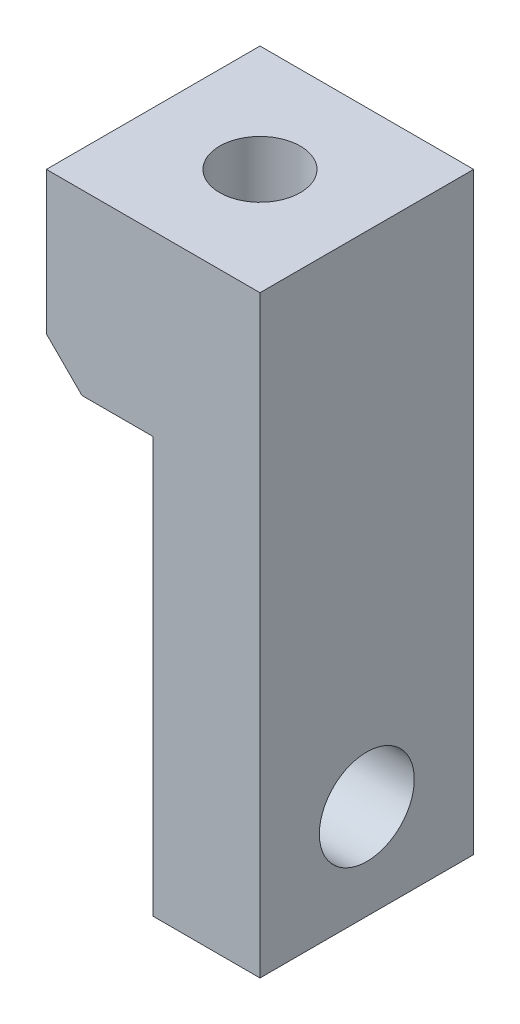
ISO-10303-21;
HEADER;
FILE_DESCRIPTION(('STEP AP214'),'2;1');
FILE_NAME('part.step','',(''),(''),'','','');
FILE_SCHEMA(('AUTOMOTIVE_DESIGN { 1 0 10303 214 1 1 1 1 }'));
ENDSEC;
DATA;
#1=APPLICATION_CONTEXT('core data for automotive mechanical design processes');
#2=APPLICATION_PROTOCOL_DEFINITION('international standard','automotive_design',2000,#1);
#3=PRODUCT_CONTEXT('',#1,'mechanical');
#4=PRODUCT('Part','Part','',(#3));
#5=PRODUCT_RELATED_PRODUCT_CATEGORY('part','',(#4));
#6=PRODUCT_DEFINITION_FORMATION('','',#4);
#7=PRODUCT_DEFINITION_CONTEXT('part definition',#1,'design');
#8=PRODUCT_DEFINITION('design','',#6,#7);
#9=PRODUCT_DEFINITION_SHAPE('','',#8);
#10=(LENGTH_UNIT() NAMED_UNIT(*) SI_UNIT(.MILLI.,.METRE.));
#11=(NAMED_UNIT(*) PLANE_ANGLE_UNIT() SI_UNIT($,.RADIAN.));
#12=(NAMED_UNIT(*) SI_UNIT($,.STERADIAN.) SOLID_ANGLE_UNIT());
#13=UNCERTAINTY_MEASURE_WITH_UNIT(LENGTH_MEASURE(1.E-05),#10,'distance_accuracy_value','');
#14=(GEOMETRIC_REPRESENTATION_CONTEXT(3) GLOBAL_UNCERTAINTY_ASSIGNED_CONTEXT((#13)) GLOBAL_UNIT_ASSIGNED_CONTEXT((#10,
#11,#12)) REPRESENTATION_CONTEXT('',''));
#15=CARTESIAN_POINT('',(0.,0.,0.));
#16=DIRECTION('',(0.,0.,1.));
#17=DIRECTION('',(1.,0.,0.));
#18=AXIS2_PLACEMENT_3D('',#15,#16,#17);
#19=CARTESIAN_POINT('',(8.99999999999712,2.22044604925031E-13,18.000000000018));
#20=DIRECTION('',(0.,1.00000000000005,0.));
#21=DIRECTION('',(-0.999999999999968,0.,0.));
#22=AXIS2_PLACEMENT_3D('',#19,#20,#21);
#23=PLANE('',#22);
#24=DIRECTION('',(0.999999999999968,0.,0.));
#25=VECTOR('',#24,1.);
#26=CARTESIAN_POINT('',(9.00000000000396,-9.99200722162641E-13,1.11022302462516E-13));
#27=LINE('',#26,#25);
#28=CARTESIAN_POINT('',(0.,0.,0.));
#29=VERTEX_POINT('',#28);
#30=CARTESIAN_POINT('',(9.00000000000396,-9.99200722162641E-13,1.11022302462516E-13));
#31=VERTEX_POINT('',#30);
#32=EDGE_CURVE('E139',#29,#31,#27,.T.);
#33=ORIENTED_EDGE('',*,*,#32,.T.);
#34=DIRECTION('',(0.,0.,-1.00000000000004));
#35=VECTOR('',#34,1.);
#36=CARTESIAN_POINT('',(8.99999999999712,2.22044604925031E-13,18.000000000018));
#37=LINE('',#36,#35);
#38=CARTESIAN_POINT('',(8.99999999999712,2.22044604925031E-13,18.000000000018));
#39=VERTEX_POINT('',#38);
#40=EDGE_CURVE('E164',#39,#31,#37,.T.);
#41=ORIENTED_EDGE('',*,*,#40,.F.);
#42=DIRECTION('',(0.999999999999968,0.,0.));
#43=VECTOR('',#42,1.);
#44=CARTESIAN_POINT('',(8.99999999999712,2.22044604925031E-13,18.000000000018));
#45=LINE('',#44,#43);
#46=CARTESIAN_POINT('',(2.60902410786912E-12,-3.33066907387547E-13,17.9999999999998));
#47=VERTEX_POINT('',#46);
#48=EDGE_CURVE('E153',#47,#39,#45,.T.);
#49=ORIENTED_EDGE('',*,*,#48,.F.);
#50=DIRECTION('',(0.,0.,-1.00000000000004));
#51=VECTOR('',#50,1.);
#52=CARTESIAN_POINT('',(2.60902410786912E-12,-3.33066907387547E-13,17.9999999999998));
#53=LINE('',#52,#51);
#54=EDGE_CURVE('E135',#47,#29,#53,.T.);
#55=ORIENTED_EDGE('',*,*,#54,.T.);
#56=EDGE_LOOP('',(#33,#41,#49,#55));
#57=FACE_BOUND('',#56,.T.);
#58=ADVANCED_FACE('F34',(#57),#23,.F.);
#59=CARTESIAN_POINT('',(9.00000000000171,50.0000000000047,17.9999999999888));
#60=DIRECTION('',(-0.999999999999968,0.,0.));
#61=DIRECTION('',(0.,-1.00000000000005,0.));
#62=AXIS2_PLACEMENT_3D('',#59,#60,#61);
#63=PLANE('',#62);
#64=CARTESIAN_POINT('',(9.00000000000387,8.00000000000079,8.99999999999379));
#65=DIRECTION('',(-0.999999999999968,0.,0.));
#66=DIRECTION('',(0.,0.,1.00000000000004));
#67=AXIS2_PLACEMENT_3D('',#64,#65,#66);
#68=CIRCLE('',#67,4.);
#69=CARTESIAN_POINT('',(9.00000000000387,8.00000000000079,12.999999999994));
#70=VERTEX_POINT('',#69);
#71=EDGE_CURVE('E241',#70,#70,#68,.T.);
#72=ORIENTED_EDGE('',*,*,#71,.T.);
#73=EDGE_LOOP('',(#72));
#74=FACE_BOUND('',#73,.T.);
#75=DIRECTION('',(0.,1.00000000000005,0.));
#76=VECTOR('',#75,1.);
#77=CARTESIAN_POINT('',(8.99999999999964,50.0000000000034,1.22124532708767E-12));
#78=LINE('',#77,#76);
#79=CARTESIAN_POINT('',(8.99999999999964,50.0000000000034,1.22124532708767E-12));
#80=VERTEX_POINT('',#79);
#81=EDGE_CURVE('E142',#31,#80,#78,.T.);
#82=ORIENTED_EDGE('',*,*,#81,.T.);
#83=DIRECTION('',(0.,0.,-1.00000000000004));
#84=VECTOR('',#83,1.);
#85=CARTESIAN_POINT('',(9.00000000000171,50.0000000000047,17.9999999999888));
#86=LINE('',#85,#84);
#87=CARTESIAN_POINT('',(9.00000000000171,50.0000000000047,17.9999999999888));
#88=VERTEX_POINT('',#87);
#89=EDGE_CURVE('E161',#88,#80,#86,.T.);
#90=ORIENTED_EDGE('',*,*,#89,.F.);
#91=DIRECTION('',(0.,1.00000000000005,0.));
#92=VECTOR('',#91,1.);
#93=CARTESIAN_POINT('',(9.00000000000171,50.0000000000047,17.9999999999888));
#94=LINE('',#93,#92);
#95=EDGE_CURVE('E95',#39,#88,#94,.T.);
#96=ORIENTED_EDGE('',*,*,#95,.F.);
#97=ORIENTED_EDGE('',*,*,#40,.T.);
#98=EDGE_LOOP('',(#82,#90,#96,#97));
#99=FACE_BOUND('',#98,.T.);
#100=ADVANCED_FACE('F204',(#74,#99),#63,.F.);
#101=CARTESIAN_POINT('',(-8.99999999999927,50.0000000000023,17.9999999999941));
#102=DIRECTION('',(0.,-1.00000000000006,0.));
#103=DIRECTION('',(0.,0.,-1.00000000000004));
#104=AXIS2_PLACEMENT_3D('',#101,#102,#103);
#105=PLANE('',#104);
#106=CARTESIAN_POINT('',(2.5882074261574E-12,50.0000000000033,9.00000000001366));
#107=DIRECTION('',(0.,1.00000000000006,0.));
#108=DIRECTION('',(0.,0.,1.00000000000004));
#109=AXIS2_PLACEMENT_3D('',#106,#107,#108);
#110=CIRCLE('',#109,3.4);
#111=CARTESIAN_POINT('',(2.5929730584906E-12,50.0000000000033,12.4000000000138));
#112=VERTEX_POINT('',#111);
#113=EDGE_CURVE('E181',#112,#112,#110,.T.);
#114=ORIENTED_EDGE('',*,*,#113,.F.);
#115=EDGE_LOOP('',(#114));
#116=FACE_BOUND('',#115,.T.);
#117=DIRECTION('',(-0.999999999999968,0.,0.));
#118=VECTOR('',#117,1.);
#119=CARTESIAN_POINT('',(-8.99999999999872,50.0000000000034,4.21884749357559E-12));
#120=LINE('',#119,#118);
#121=CARTESIAN_POINT('',(-8.99999999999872,50.0000000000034,4.21884749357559E-12));
#122=VERTEX_POINT('',#121);
#123=EDGE_CURVE('E145',#80,#122,#120,.T.);
#124=ORIENTED_EDGE('',*,*,#123,.T.);
#125=DIRECTION('',(0.,0.,-1.00000000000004));
#126=VECTOR('',#125,1.);
#127=CARTESIAN_POINT('',(-8.99999999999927,50.0000000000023,17.9999999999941));
#128=LINE('',#127,#126);
#129=CARTESIAN_POINT('',(-8.99999999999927,50.0000000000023,17.9999999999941));
#130=VERTEX_POINT('',#129);
#131=EDGE_CURVE('E158',#130,#122,#128,.T.);
#132=ORIENTED_EDGE('',*,*,#131,.F.);
#133=DIRECTION('',(-0.999999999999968,0.,0.));
#134=VECTOR('',#133,1.);
#135=CARTESIAN_POINT('',(-8.99999999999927,50.0000000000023,17.9999999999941));
#136=LINE('',#135,#134);
#137=EDGE_CURVE('E189',#88,#130,#136,.T.);
#138=ORIENTED_EDGE('',*,*,#137,.F.);
#139=ORIENTED_EDGE('',*,*,#89,.T.);
#140=EDGE_LOOP('',(#124,#132,#138,#139));
#141=FACE_BOUND('',#140,.T.);
#142=ADVANCED_FACE('F193',(#116,#141),#105,.F.);
#143=CARTESIAN_POINT('',(-8.99999999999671,38.0000000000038,18.0000000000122));
#144=DIRECTION('',(0.999999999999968,0.,0.));
#145=DIRECTION('',(0.,0.,-1.00000000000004));
#146=AXIS2_PLACEMENT_3D('',#143,#144,#145);
#147=PLANE('',#146);
#148=DIRECTION('',(0.,-1.00000000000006,0.));
#149=VECTOR('',#148,1.);
#150=CARTESIAN_POINT('',(-8.99999999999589,38.0000000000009,1.08801856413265E-11));
#151=LINE('',#150,#149);
#152=CARTESIAN_POINT('',(-8.99999999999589,38.0000000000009,1.08801856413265E-11));
#153=VERTEX_POINT('',#152);
#154=EDGE_CURVE('E147',#122,#153,#151,.T.);
#155=ORIENTED_EDGE('',*,*,#154,.T.);
#156=DIRECTION('',(0.,0.,-1.00000000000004));
#157=VECTOR('',#156,1.);
#158=CARTESIAN_POINT('',(-8.99999999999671,38.0000000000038,18.0000000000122));
#159=LINE('',#158,#157);
#160=CARTESIAN_POINT('',(-8.99999999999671,38.0000000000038,18.0000000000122));
#161=VERTEX_POINT('',#160);
#162=EDGE_CURVE('E127',#161,#153,#159,.T.);
#163=ORIENTED_EDGE('',*,*,#162,.F.);
#164=DIRECTION('',(0.,-1.00000000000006,0.));
#165=VECTOR('',#164,1.);
#166=CARTESIAN_POINT('',(-8.99999999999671,38.0000000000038,18.0000000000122));
#167=LINE('',#166,#165);
#168=EDGE_CURVE('E114',#130,#161,#167,.T.);
#169=ORIENTED_EDGE('',*,*,#168,.F.);
#170=ORIENTED_EDGE('',*,*,#131,.T.);
#171=EDGE_LOOP('',(#155,#163,#169,#170));
#172=FACE_BOUND('',#171,.T.);
#173=ADVANCED_FACE('F197',(#172),#147,.F.);
#174=CARTESIAN_POINT('',(-5.99999999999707,35.,18.0000000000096));
#175=DIRECTION('',(0.707106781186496,0.707106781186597,0.));
#176=DIRECTION('',(-0.707106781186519,0.707106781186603,0.));
#177=AXIS2_PLACEMENT_3D('',#174,#175,#176);
#178=PLANE('',#177);
#179=DIRECTION('',(0.707106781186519,-0.707106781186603,0.));
#180=VECTOR('',#179,1.);
#181=CARTESIAN_POINT('',(-6.00000000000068,35.0000000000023,3.44169137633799E-12));
#182=LINE('',#181,#180);
#183=CARTESIAN_POINT('',(-6.00000000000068,35.0000000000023,3.44169137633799E-12));
#184=VERTEX_POINT('',#183);
#185=EDGE_CURVE('E123',#153,#184,#182,.T.);
#186=ORIENTED_EDGE('',*,*,#185,.T.);
#187=DIRECTION('',(0.,0.,-1.00000000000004));
#188=VECTOR('',#187,1.);
#189=CARTESIAN_POINT('',(-5.99999999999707,35.,18.0000000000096));
#190=LINE('',#189,#188);
#191=CARTESIAN_POINT('',(-5.99999999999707,35.,18.0000000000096));
#192=VERTEX_POINT('',#191);
#193=EDGE_CURVE('E120',#192,#184,#190,.T.);
#194=ORIENTED_EDGE('',*,*,#193,.F.);
#195=DIRECTION('',(0.707106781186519,-0.707106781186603,0.));
#196=VECTOR('',#195,1.);
#197=CARTESIAN_POINT('',(-5.99999999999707,35.,18.0000000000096));
#198=LINE('',#197,#196);
#199=EDGE_CURVE('E107',#161,#192,#198,.T.);
#200=ORIENTED_EDGE('',*,*,#199,.F.);
#201=ORIENTED_EDGE('',*,*,#162,.T.);
#202=EDGE_LOOP('',(#186,#194,#200,#201));
#203=FACE_BOUND('',#202,.T.);
#204=ADVANCED_FACE('F121',(#203),#178,.F.);
#205=CARTESIAN_POINT('',(4.87110352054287E-12,35.0000000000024,18.0000000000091));
#206=DIRECTION('',(0.,1.00000000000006,0.));
#207=DIRECTION('',(0.,0.,1.00000000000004));
#208=AXIS2_PLACEMENT_3D('',#205,#206,#207);
#209=PLANE('',#208);
#210=DIRECTION('',(0.,0.,-1.00000000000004));
#211=VECTOR('',#210,1.);
#212=CARTESIAN_POINT('',(4.87110352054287E-12,35.0000000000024,18.0000000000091));
#213=LINE('',#212,#211);
#214=CARTESIAN_POINT('',(1.346145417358E-12,35.0000000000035,5.60000000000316));
#215=VERTEX_POINT('',#214);
#216=CARTESIAN_POINT('',(4.09394740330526E-12,35.0000000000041,1.08801856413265E-11));
#217=VERTEX_POINT('',#216);
#218=EDGE_CURVE('E155',#215,#217,#213,.T.);
#219=ORIENTED_EDGE('',*,*,#218,.F.);
#220=CARTESIAN_POINT('',(2.019218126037E-12,35.0000000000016,9.00000000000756));
#221=DIRECTION('',(0.,1.00000000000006,0.));
#222=DIRECTION('',(0.,0.,1.00000000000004));
#223=AXIS2_PLACEMENT_3D('',#220,#221,#222);
#224=CIRCLE('',#223,3.4);
#225=CARTESIAN_POINT('',(2.22738494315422E-12,35.0000000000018,12.4000000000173));
#226=VERTEX_POINT('',#225);
#227=EDGE_CURVE('E143',#215,#226,#224,.T.);
#228=ORIENTED_EDGE('',*,*,#227,.T.);
#229=CARTESIAN_POINT('',(4.87110352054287E-12,35.0000000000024,18.0000000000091));
#230=VERTEX_POINT('',#229);
#231=EDGE_CURVE('E128',#230,#226,#213,.T.);
#232=ORIENTED_EDGE('',*,*,#231,.F.);
#233=DIRECTION('',(0.999999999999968,0.,0.));
#234=VECTOR('',#233,1.);
#235=CARTESIAN_POINT('',(4.87110352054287E-12,35.0000000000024,18.0000000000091));
#236=LINE('',#235,#234);
#237=EDGE_CURVE('E111',#192,#230,#236,.T.);
#238=ORIENTED_EDGE('',*,*,#237,.F.);
#239=ORIENTED_EDGE('',*,*,#193,.T.);
#240=DIRECTION('',(0.999999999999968,0.,0.));
#241=VECTOR('',#240,1.);
#242=CARTESIAN_POINT('',(4.09394740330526E-12,35.0000000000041,1.08801856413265E-11));
#243=LINE('',#242,#241);
#244=EDGE_CURVE('E150',#184,#217,#243,.T.);
#245=ORIENTED_EDGE('',*,*,#244,.T.);
#246=EDGE_LOOP('',(#219,#228,#232,#238,#239,#245));
#247=FACE_BOUND('',#246,.T.);
#248=ADVANCED_FACE('F131',(#247),#209,.F.);
#249=CARTESIAN_POINT('',(2.60902410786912E-12,-3.33066907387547E-13,17.9999999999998));
#250=DIRECTION('',(0.999999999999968,0.,0.));
#251=DIRECTION('',(0.,0.,-1.00000000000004));
#252=AXIS2_PLACEMENT_3D('',#249,#250,#251);
#253=PLANE('',#252);
#254=CARTESIAN_POINT('',(-2.0122792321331E-12,8.00000000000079,9.00000000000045));
#255=DIRECTION('',(-0.999999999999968,0.,0.));
#256=DIRECTION('',(0.,0.,1.00000000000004));
#257=AXIS2_PLACEMENT_3D('',#254,#255,#256);
#258=CIRCLE('',#257,4.);
#259=CARTESIAN_POINT('',(-2.01401395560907E-12,8.00000000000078,12.9999999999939));
#260=VERTEX_POINT('',#259);
#261=EDGE_CURVE('E244',#260,#260,#258,.T.);
#262=ORIENTED_EDGE('',*,*,#261,.F.);
#263=EDGE_LOOP('',(#262));
#264=FACE_BOUND('',#263,.T.);
#265=DIRECTION('',(0.,0.51503807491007,-0.857167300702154));
#266=VECTOR('',#265,1.);
#267=CARTESIAN_POINT('',(2.09554595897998E-12,21.9570738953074,9.00000000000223));
#268=LINE('',#267,#266);
#269=CARTESIAN_POINT('',(2.09554595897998E-12,21.9570738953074,9.00000000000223));
#270=VERTEX_POINT('',#269);
#271=CARTESIAN_POINT('',(4.85028683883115E-12,24.0000000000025,5.60000000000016));
#272=VERTEX_POINT('',#271);
#273=EDGE_CURVE('E48',#270,#272,#268,.T.);
#274=ORIENTED_EDGE('',*,*,#273,.T.);
#275=DIRECTION('',(0.,1.00000000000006,0.));
#276=VECTOR('',#275,1.);
#277=CARTESIAN_POINT('',(4.92661467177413E-13,50.0000000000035,5.60000000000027));
#278=LINE('',#277,#276);
#279=EDGE_CURVE('E11',#272,#215,#278,.T.);
#280=ORIENTED_EDGE('',*,*,#279,.T.);
#281=ORIENTED_EDGE('',*,*,#218,.T.);
#282=DIRECTION('',(0.,-1.00000000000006,0.));
#283=VECTOR('',#282,1.);
#284=CARTESIAN_POINT('',(0.,0.,0.));
#285=LINE('',#284,#283);
#286=EDGE_CURVE('E86',#217,#29,#285,.T.);
#287=ORIENTED_EDGE('',*,*,#286,.T.);
#288=ORIENTED_EDGE('',*,*,#54,.F.);
#289=DIRECTION('',(0.,-1.00000000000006,0.));
#290=VECTOR('',#289,1.);
#291=CARTESIAN_POINT('',(2.60902410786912E-12,-3.33066907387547E-13,17.9999999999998));
#292=LINE('',#291,#290);
#293=EDGE_CURVE('E57',#230,#47,#292,.T.);
#294=ORIENTED_EDGE('',*,*,#293,.F.);
#295=ORIENTED_EDGE('',*,*,#231,.T.);
#296=DIRECTION('',(0.,1.00000000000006,0.));
#297=VECTOR('',#296,1.);
#298=CARTESIAN_POINT('',(4.78783679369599E-13,50.0000000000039,12.4000000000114));
#299=LINE('',#298,#297);
#300=CARTESIAN_POINT('',(6.5294991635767E-12,24.0000000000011,12.399999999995));
#301=VERTEX_POINT('',#300);
#302=EDGE_CURVE('E41',#226,#301,#299,.F.);
#303=ORIENTED_EDGE('',*,*,#302,.T.);
#304=DIRECTION('',(0.,-0.515038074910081,-0.857167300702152));
#305=VECTOR('',#304,1.);
#306=CARTESIAN_POINT('',(2.09554595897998E-12,21.9570738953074,9.00000000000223));
#307=LINE('',#306,#305);
#308=EDGE_CURVE('E166',#301,#270,#307,.T.);
#309=ORIENTED_EDGE('',*,*,#308,.T.);
#310=EDGE_LOOP('',(#274,#280,#281,#287,#288,#294,#295,#303,#309));
#311=FACE_BOUND('',#310,.T.);
#312=ADVANCED_FACE('F171',(#264,#311),#253,.F.);
#313=CARTESIAN_POINT('',(2.60902410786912E-12,-3.33066907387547E-13,17.9999999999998));
#314=DIRECTION('',(0.,0.,-1.00000000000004));
#315=DIRECTION('',(-0.999999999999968,0.,0.));
#316=AXIS2_PLACEMENT_3D('',#313,#314,#315);
#317=PLANE('',#316);
#318=ORIENTED_EDGE('',*,*,#48,.T.);
#319=ORIENTED_EDGE('',*,*,#95,.T.);
#320=ORIENTED_EDGE('',*,*,#137,.T.);
#321=ORIENTED_EDGE('',*,*,#168,.T.);
#322=ORIENTED_EDGE('',*,*,#199,.T.);
#323=ORIENTED_EDGE('',*,*,#237,.T.);
#324=ORIENTED_EDGE('',*,*,#293,.T.);
#325=EDGE_LOOP('',(#318,#319,#320,#321,#322,#323,#324));
#326=FACE_BOUND('',#325,.T.);
#327=ADVANCED_FACE('F109',(#326),#317,.F.);
#328=CARTESIAN_POINT('',(0.,0.,0.));
#329=DIRECTION('',(0.,0.,-1.00000000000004));
#330=DIRECTION('',(-0.999999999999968,0.,0.));
#331=AXIS2_PLACEMENT_3D('',#328,#329,#330);
#332=PLANE('',#331);
#333=ORIENTED_EDGE('',*,*,#32,.F.);
#334=ORIENTED_EDGE('',*,*,#286,.F.);
#335=ORIENTED_EDGE('',*,*,#244,.F.);
#336=ORIENTED_EDGE('',*,*,#185,.F.);
#337=ORIENTED_EDGE('',*,*,#154,.F.);
#338=ORIENTED_EDGE('',*,*,#123,.F.);
#339=ORIENTED_EDGE('',*,*,#81,.F.);
#340=EDGE_LOOP('',(#333,#334,#335,#336,#337,#338,#339));
#341=FACE_BOUND('',#340,.T.);
#342=ADVANCED_FACE('F200',(#341),#332,.T.);
#343=CARTESIAN_POINT('',(2.5882074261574E-12,50.0000000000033,9.00000000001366));
#344=DIRECTION('',(0.,1.00000000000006,0.));
#345=DIRECTION('',(0.,0.,1.00000000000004));
#346=AXIS2_PLACEMENT_3D('',#343,#344,#345);
#347=CYLINDRICAL_SURFACE('',#346,3.4);
#348=ORIENTED_EDGE('',*,*,#113,.T.);
#349=EDGE_LOOP('',(#348));
#350=FACE_BOUND('',#349,.T.);
#351=CARTESIAN_POINT('',(1.28369537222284E-12,24.0000000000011,9.00000000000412));
#352=DIRECTION('',(0.,1.00000000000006,0.));
#353=DIRECTION('',(0.,0.,1.00000000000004));
#354=AXIS2_PLACEMENT_3D('',#351,#352,#353);
#355=CIRCLE('',#354,3.39999999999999);
#356=EDGE_CURVE('E180',#301,#272,#355,.T.);
#357=ORIENTED_EDGE('',*,*,#356,.F.);
#358=ORIENTED_EDGE('',*,*,#302,.F.);
#359=ORIENTED_EDGE('',*,*,#227,.F.);
#360=ORIENTED_EDGE('',*,*,#279,.F.);
#361=EDGE_LOOP('',(#357,#358,#359,#360));
#362=FACE_BOUND('',#361,.T.);
#363=ADVANCED_FACE('F178',(#350,#362),#347,.F.);
#364=CARTESIAN_POINT('',(1.28369537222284E-12,24.0000000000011,9.00000000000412));
#365=DIRECTION('',(0.,1.00000000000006,0.));
#366=DIRECTION('',(0.,0.,1.00000000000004));
#367=AXIS2_PLACEMENT_3D('',#364,#365,#366);
#368=CONICAL_SURFACE('',#367,3.39999999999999,1.02974425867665);
#369=ORIENTED_EDGE('',*,*,#308,.F.);
#370=ORIENTED_EDGE('',*,*,#356,.T.);
#371=ORIENTED_EDGE('',*,*,#273,.F.);
#372=EDGE_LOOP('',(#369,#370,#371));
#373=FACE_BOUND('',#372,.T.);
#374=ADVANCED_FACE('F230',(#373),#368,.F.);
#375=CARTESIAN_POINT('',(9.00000000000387,8.00000000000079,8.99999999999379));
#376=DIRECTION('',(-0.999999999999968,0.,0.));
#377=DIRECTION('',(0.,0.,1.00000000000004));
#378=AXIS2_PLACEMENT_3D('',#375,#376,#377);
#379=CYLINDRICAL_SURFACE('',#378,4.);
#380=CARTESIAN_POINT('',(9.00000000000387,8.00000000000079,12.999999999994));
#381=CARTESIAN_POINT('',(8.90625000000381,8.00000000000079,12.999999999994));
#382=CARTESIAN_POINT('',(8.81250000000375,8.00000000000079,12.999999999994));
#383=CARTESIAN_POINT('',(8.62500000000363,8.00000000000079,12.999999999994));
#384=CARTESIAN_POINT('',(8.53125000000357,8.00000000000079,12.999999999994));
#385=CARTESIAN_POINT('',(8.34375000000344,8.00000000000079,12.999999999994));
#386=CARTESIAN_POINT('',(8.25000000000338,8.00000000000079,12.999999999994));
#387=CARTESIAN_POINT('',(8.06250000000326,8.00000000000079,12.999999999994));
#388=CARTESIAN_POINT('',(7.9687500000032,8.00000000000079,12.999999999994));
#389=CARTESIAN_POINT('',(7.78125000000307,8.00000000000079,12.999999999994));
#390=CARTESIAN_POINT('',(7.68750000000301,8.00000000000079,12.999999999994));
#391=CARTESIAN_POINT('',(7.50000000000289,8.00000000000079,12.999999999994));
#392=CARTESIAN_POINT('',(7.40625000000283,8.00000000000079,12.999999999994));
#393=CARTESIAN_POINT('',(7.21875000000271,8.00000000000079,12.999999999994));
#394=CARTESIAN_POINT('',(7.12500000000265,8.00000000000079,12.999999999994));
#395=CARTESIAN_POINT('',(6.93750000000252,8.00000000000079,12.999999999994));
#396=CARTESIAN_POINT('',(6.84375000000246,8.00000000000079,12.999999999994));
#397=CARTESIAN_POINT('',(6.65625000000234,8.00000000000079,12.999999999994));
#398=CARTESIAN_POINT('',(6.56250000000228,8.00000000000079,12.999999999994));
#399=CARTESIAN_POINT('',(6.37500000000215,8.00000000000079,12.999999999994));
#400=CARTESIAN_POINT('',(6.28125000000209,8.00000000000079,12.999999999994));
#401=CARTESIAN_POINT('',(6.09375000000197,8.00000000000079,12.999999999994));
#402=CARTESIAN_POINT('',(6.00000000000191,8.00000000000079,12.999999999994));
#403=CARTESIAN_POINT('',(5.81250000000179,8.00000000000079,12.999999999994));
#404=CARTESIAN_POINT('',(5.71875000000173,8.00000000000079,12.999999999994));
#405=CARTESIAN_POINT('',(5.5312500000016,8.00000000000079,12.999999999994));
#406=CARTESIAN_POINT('',(5.43750000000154,8.00000000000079,12.999999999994));
#407=CARTESIAN_POINT('',(5.25000000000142,8.00000000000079,12.999999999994));
#408=CARTESIAN_POINT('',(5.15625000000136,8.00000000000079,12.999999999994));
#409=CARTESIAN_POINT('',(4.96875000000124,8.00000000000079,12.999999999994));
#410=CARTESIAN_POINT('',(4.87500000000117,8.00000000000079,12.999999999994));
#411=CARTESIAN_POINT('',(4.68750000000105,8.00000000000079,12.999999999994));
#412=CARTESIAN_POINT('',(4.59375000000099,8.00000000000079,12.999999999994));
#413=CARTESIAN_POINT('',(4.40625000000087,8.00000000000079,12.999999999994));
#414=CARTESIAN_POINT('',(4.31250000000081,8.00000000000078,12.999999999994));
#415=CARTESIAN_POINT('',(4.12500000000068,8.00000000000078,12.999999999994));
#416=CARTESIAN_POINT('',(4.03125000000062,8.00000000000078,12.999999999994));
#417=CARTESIAN_POINT('',(3.8437500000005,8.00000000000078,12.999999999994));
#418=CARTESIAN_POINT('',(3.75000000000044,8.00000000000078,12.999999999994));
#419=CARTESIAN_POINT('',(3.56250000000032,8.00000000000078,12.999999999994));
#420=CARTESIAN_POINT('',(3.46875000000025,8.00000000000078,12.999999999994));
#421=CARTESIAN_POINT('',(3.28125000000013,8.00000000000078,12.999999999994));
#422=CARTESIAN_POINT('',(3.18750000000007,8.00000000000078,12.999999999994));
#423=CARTESIAN_POINT('',(2.99999999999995,8.00000000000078,12.999999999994));
#424=CARTESIAN_POINT('',(2.90624999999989,8.00000000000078,12.999999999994));
#425=CARTESIAN_POINT('',(2.71874999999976,8.00000000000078,12.999999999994));
#426=CARTESIAN_POINT('',(2.6249999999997,8.00000000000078,12.999999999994));
#427=CARTESIAN_POINT('',(2.43749999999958,8.00000000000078,12.999999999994));
#428=CARTESIAN_POINT('',(2.34374999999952,8.00000000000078,12.999999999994));
#429=CARTESIAN_POINT('',(2.1562499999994,8.00000000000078,12.999999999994));
#430=CARTESIAN_POINT('',(2.06249999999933,8.00000000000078,12.9999999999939));
#431=CARTESIAN_POINT('',(1.87499999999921,8.00000000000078,12.9999999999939));
#432=CARTESIAN_POINT('',(1.78124999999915,8.00000000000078,12.9999999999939));
#433=CARTESIAN_POINT('',(1.59374999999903,8.00000000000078,12.9999999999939));
#434=CARTESIAN_POINT('',(1.49999999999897,8.00000000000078,12.9999999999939));
#435=CARTESIAN_POINT('',(1.31249999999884,8.00000000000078,12.9999999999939));
#436=CARTESIAN_POINT('',(1.21874999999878,8.00000000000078,12.9999999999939));
#437=CARTESIAN_POINT('',(1.03124999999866,8.00000000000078,12.9999999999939));
#438=CARTESIAN_POINT('',(0.9374999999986,8.00000000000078,12.9999999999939));
#439=CARTESIAN_POINT('',(0.749999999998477,8.00000000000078,12.9999999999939));
#440=CARTESIAN_POINT('',(0.656249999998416,8.00000000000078,12.9999999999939));
#441=CARTESIAN_POINT('',(0.468749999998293,8.00000000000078,12.9999999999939));
#442=CARTESIAN_POINT('',(0.374999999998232,8.00000000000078,12.9999999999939));
#443=CARTESIAN_POINT('',(0.187499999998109,8.00000000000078,12.9999999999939));
#444=CARTESIAN_POINT('',(0.0937499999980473,8.00000000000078,12.9999999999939));
#445=CARTESIAN_POINT('',(-2.01401395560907E-12,8.00000000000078,12.9999999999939));
#446=B_SPLINE_CURVE_WITH_KNOTS('',3,(#380,#381,#382,#383,#384,#385,#386,#387,#388,#389,#390,
#391,#392,#393,#394,#395,#396,#397,#398,#399,#400,#401,#402,#403,#404,#405,#406,#407,#408,#409,
#410,#411,#412,#413,#414,#415,#416,#417,#418,#419,#420,#421,#422,#423,#424,#425,#426,#427,#428,
#429,#430,#431,#432,#433,#434,#435,#436,#437,#438,#439,#440,#441,#442,#443,#444,#445),
.UNSPECIFIED.,.F.,.F.,(4,2,2,2,2,2,2,2,2,2,2,2,2,2,2,2,2,2,2,2,2,2,2,2,2,2,2,2,2,2,2,2,4),(0.,
0.281250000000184,0.562500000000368,0.843750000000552,1.12500000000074,1.40625000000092,
1.6875000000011,1.96875000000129,2.25000000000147,2.53125000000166,2.81250000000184,
3.09375000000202,3.37500000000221,3.65625000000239,3.93750000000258,4.21875000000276,
4.50000000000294,4.78125000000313,5.06250000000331,5.3437500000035,5.62500000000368,
5.90625000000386,6.18750000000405,6.46875000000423,6.75000000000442,7.0312500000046,
7.31250000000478,7.59375000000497,7.87500000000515,8.15625000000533,8.43750000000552,
8.7187500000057,9.00000000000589),.UNSPECIFIED.);
#447=EDGE_CURVE('BSEAM234',#70,#260,#446,.T.);
#448=ORIENTED_EDGE('',*,*,#71,.F.);
#449=ORIENTED_EDGE('',*,*,#261,.T.);
#450=ORIENTED_EDGE('',*,*,#447,.T.);
#451=ORIENTED_EDGE('',*,*,#447,.F.);
#452=EDGE_LOOP('',(#448,#450,#449,#451));
#453=FACE_BOUND('',#452,.T.);
#454=ADVANCED_FACE('F234',(#453),#379,.F.);
#455=CLOSED_SHELL('',(#58,#100,#142,#173,#204,#248,#312,#327,#342,#363,#374,#454));
#456=MANIFOLD_SOLID_BREP('B2',#455);
#457=ADVANCED_BREP_SHAPE_REPRESENTATION('',(#18,#456),#14);
#458=SHAPE_DEFINITION_REPRESENTATION(#9,#457);
ENDSEC;
END-ISO-10303-21;
